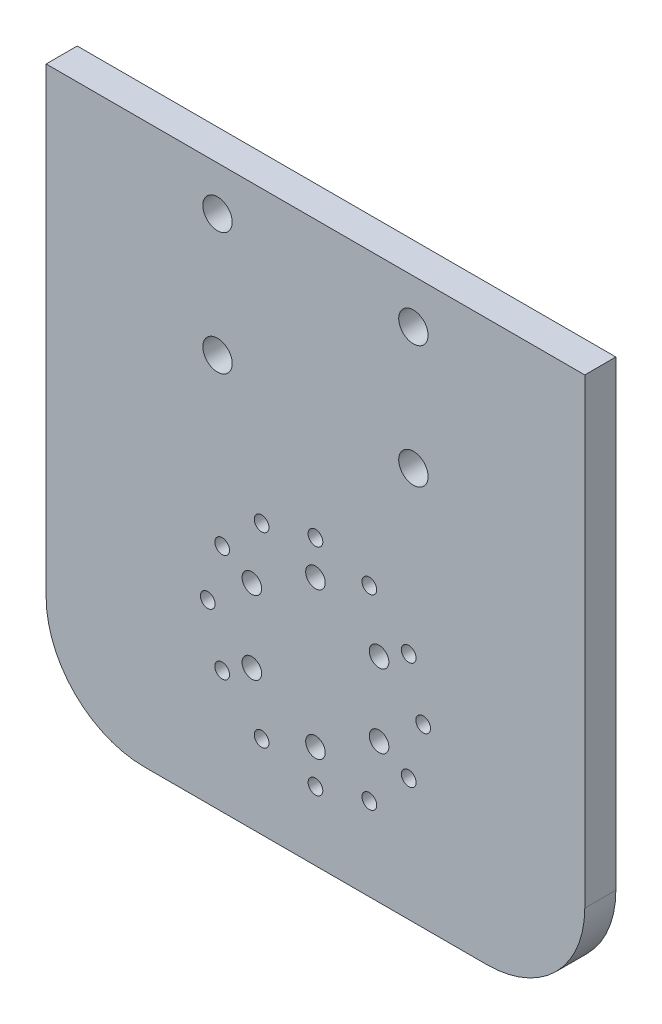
ISO-10303-21;
HEADER;
FILE_DESCRIPTION(('STEP AP214'),'2;1');
FILE_NAME('part.step','',(''),(''),'','','');
FILE_SCHEMA(('AUTOMOTIVE_DESIGN { 1 0 10303 214 1 1 1 1 }'));
ENDSEC;
DATA;
#1=APPLICATION_CONTEXT('core data for automotive mechanical design processes');
#2=APPLICATION_PROTOCOL_DEFINITION('international standard','automotive_design',2000,#1);
#3=PRODUCT_CONTEXT('',#1,'mechanical');
#4=PRODUCT('Part','Part','',(#3));
#5=PRODUCT_RELATED_PRODUCT_CATEGORY('part','',(#4));
#6=PRODUCT_DEFINITION_FORMATION('','',#4);
#7=PRODUCT_DEFINITION_CONTEXT('part definition',#1,'design');
#8=PRODUCT_DEFINITION('design','',#6,#7);
#9=PRODUCT_DEFINITION_SHAPE('','',#8);
#10=(LENGTH_UNIT() NAMED_UNIT(*) SI_UNIT(.MILLI.,.METRE.));
#11=(NAMED_UNIT(*) PLANE_ANGLE_UNIT() SI_UNIT($,.RADIAN.));
#12=(NAMED_UNIT(*) SI_UNIT($,.STERADIAN.) SOLID_ANGLE_UNIT());
#13=UNCERTAINTY_MEASURE_WITH_UNIT(LENGTH_MEASURE(1.E-05),#10,'distance_accuracy_value','');
#14=(GEOMETRIC_REPRESENTATION_CONTEXT(3) GLOBAL_UNCERTAINTY_ASSIGNED_CONTEXT((#13)) GLOBAL_UNIT_ASSIGNED_CONTEXT((#10,
#11,#12)) REPRESENTATION_CONTEXT('',''));
#15=CARTESIAN_POINT('',(0.,0.,0.));
#16=DIRECTION('',(0.,0.,1.));
#17=DIRECTION('',(1.,0.,0.));
#18=AXIS2_PLACEMENT_3D('',#15,#16,#17);
#19=CARTESIAN_POINT('',(0.,0.,6.35));
#20=DIRECTION('',(0.,0.,1.));
#21=DIRECTION('',(1.,0.,0.));
#22=AXIS2_PLACEMENT_3D('',#19,#20,#21);
#23=PLANE('',#22);
#24=CARTESIAN_POINT('',(20.,44.3,6.35));
#25=DIRECTION('',(0.,0.,1.));
#26=DIRECTION('',(1.,0.,0.));
#27=AXIS2_PLACEMENT_3D('',#24,#25,#26);
#28=CIRCLE('',#27,3.00000000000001);
#29=CARTESIAN_POINT('',(23.,44.3,6.35));
#30=VERTEX_POINT('',#29);
#31=EDGE_CURVE('E297',#30,#30,#28,.T.);
#32=ORIENTED_EDGE('',*,*,#31,.F.);
#33=EDGE_LOOP('',(#32));
#34=FACE_BOUND('',#33,.T.);
#35=CARTESIAN_POINT('',(-20.,69.3,6.35));
#36=DIRECTION('',(0.,0.,1.));
#37=DIRECTION('',(1.,0.,0.));
#38=AXIS2_PLACEMENT_3D('',#35,#36,#37);
#39=CIRCLE('',#38,3.00000000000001);
#40=CARTESIAN_POINT('',(-17.,69.3,6.35));
#41=VERTEX_POINT('',#40);
#42=EDGE_CURVE('E311',#41,#41,#39,.T.);
#43=ORIENTED_EDGE('',*,*,#42,.F.);
#44=EDGE_LOOP('',(#43));
#45=FACE_BOUND('',#44,.T.);
#46=CARTESIAN_POINT('',(-19.0525588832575,11.0000000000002,6.35));
#47=DIRECTION('',(0.,0.,1.));
#48=DIRECTION('',(1.,0.,0.));
#49=AXIS2_PLACEMENT_3D('',#46,#47,#48);
#50=CIRCLE('',#49,1.5);
#51=CARTESIAN_POINT('',(-17.5525588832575,11.0000000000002,6.35));
#52=VERTEX_POINT('',#51);
#53=EDGE_CURVE('E328',#52,#52,#50,.T.);
#54=ORIENTED_EDGE('',*,*,#53,.F.);
#55=EDGE_LOOP('',(#54));
#56=FACE_BOUND('',#55,.T.);
#57=CARTESIAN_POINT('',(-19.0525588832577,-10.9999999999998,6.35));
#58=DIRECTION('',(0.,0.,1.));
#59=DIRECTION('',(1.,0.,0.));
#60=AXIS2_PLACEMENT_3D('',#57,#58,#59);
#61=CIRCLE('',#60,1.5);
#62=CARTESIAN_POINT('',(-17.5525588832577,-10.9999999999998,6.35));
#63=VERTEX_POINT('',#62);
#64=EDGE_CURVE('E342',#63,#63,#61,.T.);
#65=ORIENTED_EDGE('',*,*,#64,.F.);
#66=EDGE_LOOP('',(#65));
#67=FACE_BOUND('',#66,.T.);
#68=CARTESIAN_POINT('',(-1.53625178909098E-13,-22.,6.35));
#69=DIRECTION('',(0.,0.,1.));
#70=DIRECTION('',(1.,0.,0.));
#71=AXIS2_PLACEMENT_3D('',#68,#69,#70);
#72=CIRCLE('',#71,1.5);
#73=CARTESIAN_POINT('',(1.49999999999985,-22.,6.35));
#74=VERTEX_POINT('',#73);
#75=EDGE_CURVE('E363',#74,#74,#72,.T.);
#76=ORIENTED_EDGE('',*,*,#75,.F.);
#77=EDGE_LOOP('',(#76));
#78=FACE_BOUND('',#77,.T.);
#79=CARTESIAN_POINT('',(19.0525588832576,-11.0000000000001,6.35));
#80=DIRECTION('',(0.,0.,1.));
#81=DIRECTION('',(1.,0.,0.));
#82=AXIS2_PLACEMENT_3D('',#79,#80,#81);
#83=CIRCLE('',#82,1.5);
#84=CARTESIAN_POINT('',(20.5525588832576,-11.0000000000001,6.35));
#85=VERTEX_POINT('',#84);
#86=EDGE_CURVE('E380',#85,#85,#83,.T.);
#87=ORIENTED_EDGE('',*,*,#86,.F.);
#88=EDGE_LOOP('',(#87));
#89=FACE_BOUND('',#88,.T.);
#90=CARTESIAN_POINT('',(19.0525588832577,11.,6.35));
#91=DIRECTION('',(0.,0.,1.));
#92=DIRECTION('',(1.,0.,0.));
#93=AXIS2_PLACEMENT_3D('',#90,#91,#92);
#94=CIRCLE('',#93,1.5);
#95=CARTESIAN_POINT('',(20.5525588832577,11.,6.35));
#96=VERTEX_POINT('',#95);
#97=EDGE_CURVE('E394',#96,#96,#94,.T.);
#98=ORIENTED_EDGE('',*,*,#97,.F.);
#99=EDGE_LOOP('',(#98));
#100=FACE_BOUND('',#99,.T.);
#101=CARTESIAN_POINT('',(-12.9903810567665,7.50000000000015,6.35));
#102=DIRECTION('',(0.,0.,1.));
#103=DIRECTION('',(1.,0.,0.));
#104=AXIS2_PLACEMENT_3D('',#101,#102,#103);
#105=CIRCLE('',#104,2.);
#106=CARTESIAN_POINT('',(-10.9903810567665,7.50000000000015,6.35));
#107=VERTEX_POINT('',#106);
#108=EDGE_CURVE('E408',#107,#107,#105,.T.);
#109=ORIENTED_EDGE('',*,*,#108,.F.);
#110=EDGE_LOOP('',(#109));
#111=FACE_BOUND('',#110,.T.);
#112=CARTESIAN_POINT('',(-1.04744440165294E-13,-15.,6.35));
#113=DIRECTION('',(0.,0.,1.));
#114=DIRECTION('',(1.,0.,0.));
#115=AXIS2_PLACEMENT_3D('',#112,#113,#114);
#116=CIRCLE('',#115,2.);
#117=CARTESIAN_POINT('',(1.9999999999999,-15.,6.35));
#118=VERTEX_POINT('',#117);
#119=EDGE_CURVE('E422',#118,#118,#116,.T.);
#120=ORIENTED_EDGE('',*,*,#119,.F.);
#121=EDGE_LOOP('',(#120));
#122=FACE_BOUND('',#121,.T.);
#123=CARTESIAN_POINT('',(12.9903810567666,7.49999999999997,6.35));
#124=DIRECTION('',(0.,0.,1.));
#125=DIRECTION('',(1.,0.,0.));
#126=AXIS2_PLACEMENT_3D('',#123,#124,#125);
#127=CIRCLE('',#126,2.);
#128=CARTESIAN_POINT('',(14.9903810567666,7.49999999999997,6.35));
#129=VERTEX_POINT('',#128);
#130=EDGE_CURVE('E442',#129,#129,#127,.T.);
#131=ORIENTED_EDGE('',*,*,#130,.F.);
#132=EDGE_LOOP('',(#131));
#133=FACE_BOUND('',#132,.T.);
#134=CARTESIAN_POINT('',(0.,15.,6.35));
#135=DIRECTION('',(0.,0.,1.));
#136=DIRECTION('',(1.,0.,0.));
#137=AXIS2_PLACEMENT_3D('',#134,#135,#136);
#138=CIRCLE('',#137,2.);
#139=CARTESIAN_POINT('',(2.,15.,6.35));
#140=VERTEX_POINT('',#139);
#141=EDGE_CURVE('E133',#140,#140,#138,.T.);
#142=ORIENTED_EDGE('',*,*,#141,.F.);
#143=EDGE_LOOP('',(#142));
#144=FACE_BOUND('',#143,.T.);
#145=DIRECTION('',(0.,-1.,0.));
#146=VECTOR('',#145,1.);
#147=CARTESIAN_POINT('',(-55.,-36.,6.35));
#148=LINE('',#147,#146);
#149=CARTESIAN_POINT('',(-55.,78.3,6.35));
#150=VERTEX_POINT('',#149);
#151=CARTESIAN_POINT('',(-55.,-15.9999999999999,6.35));
#152=VERTEX_POINT('',#151);
#153=EDGE_CURVE('E123',#150,#152,#148,.T.);
#154=ORIENTED_EDGE('',*,*,#153,.T.);
#155=CARTESIAN_POINT('',(-35.,-15.9999999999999,6.35));
#156=DIRECTION('',(0.,0.,1.));
#157=DIRECTION('',(1.,0.,0.));
#158=AXIS2_PLACEMENT_3D('',#155,#156,#157);
#159=CIRCLE('',#158,20.);
#160=CARTESIAN_POINT('',(-35.,-36.,6.35));
#161=VERTEX_POINT('',#160);
#162=EDGE_CURVE('E53',#152,#161,#159,.T.);
#163=ORIENTED_EDGE('',*,*,#162,.T.);
#164=DIRECTION('',(1.,0.,0.));
#165=VECTOR('',#164,1.);
#166=CARTESIAN_POINT('',(-55.,-36.,6.35));
#167=LINE('',#166,#165);
#168=CARTESIAN_POINT('',(35.,-36.,6.35));
#169=VERTEX_POINT('',#168);
#170=EDGE_CURVE('E107',#161,#169,#167,.T.);
#171=ORIENTED_EDGE('',*,*,#170,.T.);
#172=CARTESIAN_POINT('',(35.,-15.9999999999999,6.35));
#173=DIRECTION('',(0.,0.,1.));
#174=DIRECTION('',(1.,0.,0.));
#175=AXIS2_PLACEMENT_3D('',#172,#173,#174);
#176=CIRCLE('',#175,20.);
#177=CARTESIAN_POINT('',(55.,-15.9999999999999,6.35));
#178=VERTEX_POINT('',#177);
#179=EDGE_CURVE('E61',#169,#178,#176,.T.);
#180=ORIENTED_EDGE('',*,*,#179,.T.);
#181=DIRECTION('',(0.,1.,0.));
#182=VECTOR('',#181,1.);
#183=CARTESIAN_POINT('',(55.,-36.,6.35));
#184=LINE('',#183,#182);
#185=CARTESIAN_POINT('',(55.,78.3,6.35));
#186=VERTEX_POINT('',#185);
#187=EDGE_CURVE('E97',#178,#186,#184,.T.);
#188=ORIENTED_EDGE('',*,*,#187,.T.);
#189=DIRECTION('',(-1.,0.,0.));
#190=VECTOR('',#189,1.);
#191=CARTESIAN_POINT('',(-55.,78.3,6.35));
#192=LINE('',#191,#190);
#193=EDGE_CURVE('E103',#186,#150,#192,.T.);
#194=ORIENTED_EDGE('',*,*,#193,.T.);
#195=EDGE_LOOP('',(#154,#163,#171,#180,#188,#194));
#196=FACE_BOUND('',#195,.T.);
#197=CARTESIAN_POINT('',(0.,22.,6.35));
#198=DIRECTION('',(0.,0.,1.));
#199=DIRECTION('',(1.,0.,0.));
#200=AXIS2_PLACEMENT_3D('',#197,#198,#199);
#201=CIRCLE('',#200,1.5);
#202=CARTESIAN_POINT('',(1.5,22.,6.35));
#203=VERTEX_POINT('',#202);
#204=EDGE_CURVE('E448',#203,#203,#201,.T.);
#205=ORIENTED_EDGE('',*,*,#204,.F.);
#206=EDGE_LOOP('',(#205));
#207=FACE_BOUND('',#206,.T.);
#208=CARTESIAN_POINT('',(12.9903810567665,-7.50000000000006,6.35));
#209=DIRECTION('',(0.,0.,1.));
#210=DIRECTION('',(1.,0.,0.));
#211=AXIS2_PLACEMENT_3D('',#208,#209,#210);
#212=CIRCLE('',#211,2.);
#213=CARTESIAN_POINT('',(14.9903810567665,-7.50000000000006,6.35));
#214=VERTEX_POINT('',#213);
#215=EDGE_CURVE('E433',#214,#214,#212,.T.);
#216=ORIENTED_EDGE('',*,*,#215,.F.);
#217=EDGE_LOOP('',(#216));
#218=FACE_BOUND('',#217,.T.);
#219=CARTESIAN_POINT('',(-12.9903810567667,-7.49999999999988,6.35));
#220=DIRECTION('',(0.,0.,1.));
#221=DIRECTION('',(1.,0.,0.));
#222=AXIS2_PLACEMENT_3D('',#219,#220,#221);
#223=CIRCLE('',#222,2.);
#224=CARTESIAN_POINT('',(-10.9903810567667,-7.49999999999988,6.35));
#225=VERTEX_POINT('',#224);
#226=EDGE_CURVE('E417',#225,#225,#223,.T.);
#227=ORIENTED_EDGE('',*,*,#226,.F.);
#228=EDGE_LOOP('',(#227));
#229=FACE_BOUND('',#228,.T.);
#230=CARTESIAN_POINT('',(11.,19.0525588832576,6.35));
#231=DIRECTION('',(0.,0.,1.));
#232=DIRECTION('',(1.,0.,0.));
#233=AXIS2_PLACEMENT_3D('',#230,#231,#232);
#234=CIRCLE('',#233,1.5);
#235=CARTESIAN_POINT('',(12.5,19.0525588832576,6.35));
#236=VERTEX_POINT('',#235);
#237=EDGE_CURVE('E402',#236,#236,#234,.T.);
#238=ORIENTED_EDGE('',*,*,#237,.F.);
#239=EDGE_LOOP('',(#238));
#240=FACE_BOUND('',#239,.T.);
#241=CARTESIAN_POINT('',(22.,0.,6.35));
#242=DIRECTION('',(0.,0.,1.));
#243=DIRECTION('',(1.,0.,0.));
#244=AXIS2_PLACEMENT_3D('',#241,#242,#243);
#245=CIRCLE('',#244,1.5);
#246=CARTESIAN_POINT('',(23.5,0.,6.35));
#247=VERTEX_POINT('',#246);
#248=EDGE_CURVE('E384',#247,#247,#245,.T.);
#249=ORIENTED_EDGE('',*,*,#248,.F.);
#250=EDGE_LOOP('',(#249));
#251=FACE_BOUND('',#250,.T.);
#252=CARTESIAN_POINT('',(10.9999999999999,-19.0525588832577,6.35));
#253=DIRECTION('',(0.,0.,1.));
#254=DIRECTION('',(1.,0.,0.));
#255=AXIS2_PLACEMENT_3D('',#252,#253,#254);
#256=CIRCLE('',#255,1.5);
#257=CARTESIAN_POINT('',(12.4999999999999,-19.0525588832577,6.35));
#258=VERTEX_POINT('',#257);
#259=EDGE_CURVE('E369',#258,#258,#256,.T.);
#260=ORIENTED_EDGE('',*,*,#259,.F.);
#261=EDGE_LOOP('',(#260));
#262=FACE_BOUND('',#261,.T.);
#263=CARTESIAN_POINT('',(-11.0000000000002,-19.0525588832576,6.35));
#264=DIRECTION('',(0.,0.,1.));
#265=DIRECTION('',(1.,0.,0.));
#266=AXIS2_PLACEMENT_3D('',#263,#264,#265);
#267=CIRCLE('',#266,1.5);
#268=CARTESIAN_POINT('',(-9.50000000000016,-19.0525588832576,6.35));
#269=VERTEX_POINT('',#268);
#270=EDGE_CURVE('E354',#269,#269,#267,.T.);
#271=ORIENTED_EDGE('',*,*,#270,.F.);
#272=EDGE_LOOP('',(#271));
#273=FACE_BOUND('',#272,.T.);
#274=CARTESIAN_POINT('',(-22.,2.30437768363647E-13,6.35));
#275=DIRECTION('',(0.,0.,1.));
#276=DIRECTION('',(1.,0.,0.));
#277=AXIS2_PLACEMENT_3D('',#274,#275,#276);
#278=CIRCLE('',#277,1.5);
#279=CARTESIAN_POINT('',(-20.5,2.30437768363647E-13,6.35));
#280=VERTEX_POINT('',#279);
#281=EDGE_CURVE('E337',#280,#280,#278,.T.);
#282=ORIENTED_EDGE('',*,*,#281,.F.);
#283=EDGE_LOOP('',(#282));
#284=FACE_BOUND('',#283,.T.);
#285=CARTESIAN_POINT('',(-10.9999999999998,19.0525588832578,6.35));
#286=DIRECTION('',(0.,0.,1.));
#287=DIRECTION('',(1.,0.,0.));
#288=AXIS2_PLACEMENT_3D('',#285,#286,#287);
#289=CIRCLE('',#288,1.5);
#290=CARTESIAN_POINT('',(-9.49999999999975,19.0525588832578,6.35));
#291=VERTEX_POINT('',#290);
#292=EDGE_CURVE('E321',#291,#291,#289,.T.);
#293=ORIENTED_EDGE('',*,*,#292,.F.);
#294=EDGE_LOOP('',(#293));
#295=FACE_BOUND('',#294,.T.);
#296=CARTESIAN_POINT('',(-20.,44.3,6.35));
#297=DIRECTION('',(0.,0.,1.));
#298=DIRECTION('',(1.,0.,0.));
#299=AXIS2_PLACEMENT_3D('',#296,#297,#298);
#300=CIRCLE('',#299,3.00000000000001);
#301=CARTESIAN_POINT('',(-17.,44.3,6.35));
#302=VERTEX_POINT('',#301);
#303=EDGE_CURVE('E302',#302,#302,#300,.T.);
#304=ORIENTED_EDGE('',*,*,#303,.F.);
#305=EDGE_LOOP('',(#304));
#306=FACE_BOUND('',#305,.T.);
#307=CARTESIAN_POINT('',(20.,69.3,6.35));
#308=DIRECTION('',(0.,0.,1.));
#309=DIRECTION('',(1.,0.,0.));
#310=AXIS2_PLACEMENT_3D('',#307,#308,#309);
#311=CIRCLE('',#310,3.00000000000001);
#312=CARTESIAN_POINT('',(23.,69.3,6.35));
#313=VERTEX_POINT('',#312);
#314=EDGE_CURVE('E289',#313,#313,#311,.T.);
#315=ORIENTED_EDGE('',*,*,#314,.F.);
#316=EDGE_LOOP('',(#315));
#317=FACE_BOUND('',#316,.T.);
#318=ADVANCED_FACE('F44',(#34,#45,#56,#67,#78,#89,#100,#111,#122,#133,#144,#196,#207,#218,#229,
#240,#251,#262,#273,#284,#295,#306,#317),#23,.T.);
#319=CARTESIAN_POINT('',(0.,0.,0.));
#320=DIRECTION('',(0.,0.,1.));
#321=DIRECTION('',(1.,0.,0.));
#322=AXIS2_PLACEMENT_3D('',#319,#320,#321);
#323=PLANE('',#322);
#324=DIRECTION('',(1.,0.,0.));
#325=VECTOR('',#324,1.);
#326=CARTESIAN_POINT('',(-55.,-36.,0.));
#327=LINE('',#326,#325);
#328=CARTESIAN_POINT('',(-35.,-36.,0.));
#329=VERTEX_POINT('',#328);
#330=CARTESIAN_POINT('',(35.,-36.,0.));
#331=VERTEX_POINT('',#330);
#332=EDGE_CURVE('E128',#329,#331,#327,.T.);
#333=ORIENTED_EDGE('',*,*,#332,.F.);
#334=CARTESIAN_POINT('',(-35.,-15.9999999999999,0.));
#335=DIRECTION('',(0.,0.,1.));
#336=DIRECTION('',(1.,0.,0.));
#337=AXIS2_PLACEMENT_3D('',#334,#335,#336);
#338=CIRCLE('',#337,20.);
#339=CARTESIAN_POINT('',(-55.,-15.9999999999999,0.));
#340=VERTEX_POINT('',#339);
#341=EDGE_CURVE('E152',#329,#340,#338,.F.);
#342=ORIENTED_EDGE('',*,*,#341,.T.);
#343=DIRECTION('',(0.,-1.,0.));
#344=VECTOR('',#343,1.);
#345=CARTESIAN_POINT('',(-55.,-36.,0.));
#346=LINE('',#345,#344);
#347=CARTESIAN_POINT('',(-55.,78.3,0.));
#348=VERTEX_POINT('',#347);
#349=EDGE_CURVE('E137',#348,#340,#346,.T.);
#350=ORIENTED_EDGE('',*,*,#349,.F.);
#351=DIRECTION('',(-1.,0.,0.));
#352=VECTOR('',#351,1.);
#353=CARTESIAN_POINT('',(-55.,78.3,0.));
#354=LINE('',#353,#352);
#355=CARTESIAN_POINT('',(55.,78.3,0.));
#356=VERTEX_POINT('',#355);
#357=EDGE_CURVE('E136',#356,#348,#354,.T.);
#358=ORIENTED_EDGE('',*,*,#357,.F.);
#359=DIRECTION('',(0.,1.,0.));
#360=VECTOR('',#359,1.);
#361=CARTESIAN_POINT('',(55.,-36.,0.));
#362=LINE('',#361,#360);
#363=CARTESIAN_POINT('',(55.,-15.9999999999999,0.));
#364=VERTEX_POINT('',#363);
#365=EDGE_CURVE('E111',#364,#356,#362,.T.);
#366=ORIENTED_EDGE('',*,*,#365,.F.);
#367=CARTESIAN_POINT('',(35.,-15.9999999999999,0.));
#368=DIRECTION('',(0.,0.,1.));
#369=DIRECTION('',(1.,0.,0.));
#370=AXIS2_PLACEMENT_3D('',#367,#368,#369);
#371=CIRCLE('',#370,20.);
#372=EDGE_CURVE('E151',#364,#331,#371,.F.);
#373=ORIENTED_EDGE('',*,*,#372,.T.);
#374=EDGE_LOOP('',(#333,#342,#350,#358,#366,#373));
#375=FACE_BOUND('',#374,.T.);
#376=CARTESIAN_POINT('',(0.,15.,0.));
#377=DIRECTION('',(0.,0.,1.));
#378=DIRECTION('',(1.,0.,0.));
#379=AXIS2_PLACEMENT_3D('',#376,#377,#378);
#380=CIRCLE('',#379,2.);
#381=CARTESIAN_POINT('',(2.,15.,0.));
#382=VERTEX_POINT('',#381);
#383=EDGE_CURVE('E455',#382,#382,#380,.T.);
#384=ORIENTED_EDGE('',*,*,#383,.T.);
#385=EDGE_LOOP('',(#384));
#386=FACE_BOUND('',#385,.T.);
#387=CARTESIAN_POINT('',(0.,22.,0.));
#388=DIRECTION('',(0.,0.,1.));
#389=DIRECTION('',(1.,0.,0.));
#390=AXIS2_PLACEMENT_3D('',#387,#388,#389);
#391=CIRCLE('',#390,1.5);
#392=CARTESIAN_POINT('',(1.5,22.,0.));
#393=VERTEX_POINT('',#392);
#394=EDGE_CURVE('E443',#393,#393,#391,.T.);
#395=ORIENTED_EDGE('',*,*,#394,.T.);
#396=EDGE_LOOP('',(#395));
#397=FACE_BOUND('',#396,.T.);
#398=CARTESIAN_POINT('',(12.9903810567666,7.49999999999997,0.));
#399=DIRECTION('',(0.,0.,1.));
#400=DIRECTION('',(1.,0.,0.));
#401=AXIS2_PLACEMENT_3D('',#398,#399,#400);
#402=CIRCLE('',#401,2.);
#403=CARTESIAN_POINT('',(14.9903810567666,7.49999999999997,0.));
#404=VERTEX_POINT('',#403);
#405=EDGE_CURVE('E440',#404,#404,#402,.T.);
#406=ORIENTED_EDGE('',*,*,#405,.T.);
#407=EDGE_LOOP('',(#406));
#408=FACE_BOUND('',#407,.T.);
#409=CARTESIAN_POINT('',(12.9903810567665,-7.50000000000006,0.));
#410=DIRECTION('',(0.,0.,1.));
#411=DIRECTION('',(1.,0.,0.));
#412=AXIS2_PLACEMENT_3D('',#409,#410,#411);
#413=CIRCLE('',#412,2.);
#414=CARTESIAN_POINT('',(14.9903810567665,-7.50000000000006,0.));
#415=VERTEX_POINT('',#414);
#416=EDGE_CURVE('E427',#415,#415,#413,.T.);
#417=ORIENTED_EDGE('',*,*,#416,.T.);
#418=EDGE_LOOP('',(#417));
#419=FACE_BOUND('',#418,.T.);
#420=CARTESIAN_POINT('',(-1.04744440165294E-13,-15.,0.));
#421=DIRECTION('',(0.,0.,1.));
#422=DIRECTION('',(1.,0.,0.));
#423=AXIS2_PLACEMENT_3D('',#420,#421,#422);
#424=CIRCLE('',#423,2.);
#425=CARTESIAN_POINT('',(1.9999999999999,-15.,0.));
#426=VERTEX_POINT('',#425);
#427=EDGE_CURVE('E423',#426,#426,#424,.T.);
#428=ORIENTED_EDGE('',*,*,#427,.T.);
#429=EDGE_LOOP('',(#428));
#430=FACE_BOUND('',#429,.T.);
#431=CARTESIAN_POINT('',(-12.9903810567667,-7.49999999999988,0.));
#432=DIRECTION('',(0.,0.,1.));
#433=DIRECTION('',(1.,0.,0.));
#434=AXIS2_PLACEMENT_3D('',#431,#432,#433);
#435=CIRCLE('',#434,2.);
#436=CARTESIAN_POINT('',(-10.9903810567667,-7.49999999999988,0.));
#437=VERTEX_POINT('',#436);
#438=EDGE_CURVE('E415',#437,#437,#435,.T.);
#439=ORIENTED_EDGE('',*,*,#438,.T.);
#440=EDGE_LOOP('',(#439));
#441=FACE_BOUND('',#440,.T.);
#442=CARTESIAN_POINT('',(-12.9903810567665,7.50000000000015,0.));
#443=DIRECTION('',(0.,0.,1.));
#444=DIRECTION('',(1.,0.,0.));
#445=AXIS2_PLACEMENT_3D('',#442,#443,#444);
#446=CIRCLE('',#445,2.);
#447=CARTESIAN_POINT('',(-10.9903810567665,7.50000000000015,0.));
#448=VERTEX_POINT('',#447);
#449=EDGE_CURVE('E403',#448,#448,#446,.T.);
#450=ORIENTED_EDGE('',*,*,#449,.T.);
#451=EDGE_LOOP('',(#450));
#452=FACE_BOUND('',#451,.T.);
#453=CARTESIAN_POINT('',(11.,19.0525588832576,0.));
#454=DIRECTION('',(0.,0.,1.));
#455=DIRECTION('',(1.,0.,0.));
#456=AXIS2_PLACEMENT_3D('',#453,#454,#455);
#457=CIRCLE('',#456,1.5);
#458=CARTESIAN_POINT('',(12.5,19.0525588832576,0.));
#459=VERTEX_POINT('',#458);
#460=EDGE_CURVE('E396',#459,#459,#457,.T.);
#461=ORIENTED_EDGE('',*,*,#460,.T.);
#462=EDGE_LOOP('',(#461));
#463=FACE_BOUND('',#462,.T.);
#464=CARTESIAN_POINT('',(19.0525588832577,11.,0.));
#465=DIRECTION('',(0.,0.,1.));
#466=DIRECTION('',(1.,0.,0.));
#467=AXIS2_PLACEMENT_3D('',#464,#465,#466);
#468=CIRCLE('',#467,1.5);
#469=CARTESIAN_POINT('',(20.5525588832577,11.,0.));
#470=VERTEX_POINT('',#469);
#471=EDGE_CURVE('E386',#470,#470,#468,.T.);
#472=ORIENTED_EDGE('',*,*,#471,.T.);
#473=EDGE_LOOP('',(#472));
#474=FACE_BOUND('',#473,.T.);
#475=CARTESIAN_POINT('',(22.,0.,0.));
#476=DIRECTION('',(0.,0.,1.));
#477=DIRECTION('',(1.,0.,0.));
#478=AXIS2_PLACEMENT_3D('',#475,#476,#477);
#479=CIRCLE('',#478,1.5);
#480=CARTESIAN_POINT('',(23.5,0.,0.));
#481=VERTEX_POINT('',#480);
#482=EDGE_CURVE('E381',#481,#481,#479,.T.);
#483=ORIENTED_EDGE('',*,*,#482,.T.);
#484=EDGE_LOOP('',(#483));
#485=FACE_BOUND('',#484,.T.);
#486=CARTESIAN_POINT('',(19.0525588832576,-11.0000000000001,0.));
#487=DIRECTION('',(0.,0.,1.));
#488=DIRECTION('',(1.,0.,0.));
#489=AXIS2_PLACEMENT_3D('',#486,#487,#488);
#490=CIRCLE('',#489,1.5);
#491=CARTESIAN_POINT('',(20.5525588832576,-11.0000000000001,0.));
#492=VERTEX_POINT('',#491);
#493=EDGE_CURVE('E373',#492,#492,#490,.T.);
#494=ORIENTED_EDGE('',*,*,#493,.T.);
#495=EDGE_LOOP('',(#494));
#496=FACE_BOUND('',#495,.T.);
#497=CARTESIAN_POINT('',(10.9999999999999,-19.0525588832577,0.));
#498=DIRECTION('',(0.,0.,1.));
#499=DIRECTION('',(1.,0.,0.));
#500=AXIS2_PLACEMENT_3D('',#497,#498,#499);
#501=CIRCLE('',#500,1.5);
#502=CARTESIAN_POINT('',(12.4999999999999,-19.0525588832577,0.));
#503=VERTEX_POINT('',#502);
#504=EDGE_CURVE('E364',#503,#503,#501,.T.);
#505=ORIENTED_EDGE('',*,*,#504,.T.);
#506=EDGE_LOOP('',(#505));
#507=FACE_BOUND('',#506,.T.);
#508=CARTESIAN_POINT('',(-1.53625178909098E-13,-22.,0.));
#509=DIRECTION('',(0.,0.,1.));
#510=DIRECTION('',(1.,0.,0.));
#511=AXIS2_PLACEMENT_3D('',#508,#509,#510);
#512=CIRCLE('',#511,1.5);
#513=CARTESIAN_POINT('',(1.49999999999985,-22.,0.));
#514=VERTEX_POINT('',#513);
#515=EDGE_CURVE('E356',#514,#514,#512,.T.);
#516=ORIENTED_EDGE('',*,*,#515,.T.);
#517=EDGE_LOOP('',(#516));
#518=FACE_BOUND('',#517,.T.);
#519=CARTESIAN_POINT('',(-11.0000000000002,-19.0525588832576,0.));
#520=DIRECTION('',(0.,0.,1.));
#521=DIRECTION('',(1.,0.,0.));
#522=AXIS2_PLACEMENT_3D('',#519,#520,#521);
#523=CIRCLE('',#522,1.5);
#524=CARTESIAN_POINT('',(-9.50000000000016,-19.0525588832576,0.));
#525=VERTEX_POINT('',#524);
#526=EDGE_CURVE('E349',#525,#525,#523,.T.);
#527=ORIENTED_EDGE('',*,*,#526,.T.);
#528=EDGE_LOOP('',(#527));
#529=FACE_BOUND('',#528,.T.);
#530=CARTESIAN_POINT('',(-19.0525588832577,-10.9999999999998,0.));
#531=DIRECTION('',(0.,0.,1.));
#532=DIRECTION('',(1.,0.,0.));
#533=AXIS2_PLACEMENT_3D('',#530,#531,#532);
#534=CIRCLE('',#533,1.5);
#535=CARTESIAN_POINT('',(-17.5525588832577,-10.9999999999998,0.));
#536=VERTEX_POINT('',#535);
#537=EDGE_CURVE('E344',#536,#536,#534,.T.);
#538=ORIENTED_EDGE('',*,*,#537,.T.);
#539=EDGE_LOOP('',(#538));
#540=FACE_BOUND('',#539,.T.);
#541=CARTESIAN_POINT('',(-22.,2.30437768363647E-13,0.));
#542=DIRECTION('',(0.,0.,1.));
#543=DIRECTION('',(1.,0.,0.));
#544=AXIS2_PLACEMENT_3D('',#541,#542,#543);
#545=CIRCLE('',#544,1.5);
#546=CARTESIAN_POINT('',(-20.5,2.30437768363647E-13,0.));
#547=VERTEX_POINT('',#546);
#548=EDGE_CURVE('E334',#547,#547,#545,.T.);
#549=ORIENTED_EDGE('',*,*,#548,.T.);
#550=EDGE_LOOP('',(#549));
#551=FACE_BOUND('',#550,.T.);
#552=CARTESIAN_POINT('',(-19.0525588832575,11.0000000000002,0.));
#553=DIRECTION('',(0.,0.,1.));
#554=DIRECTION('',(1.,0.,0.));
#555=AXIS2_PLACEMENT_3D('',#552,#553,#554);
#556=CIRCLE('',#555,1.5);
#557=CARTESIAN_POINT('',(-17.5525588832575,11.0000000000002,0.));
#558=VERTEX_POINT('',#557);
#559=EDGE_CURVE('E324',#558,#558,#556,.T.);
#560=ORIENTED_EDGE('',*,*,#559,.T.);
#561=EDGE_LOOP('',(#560));
#562=FACE_BOUND('',#561,.T.);
#563=CARTESIAN_POINT('',(-10.9999999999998,19.0525588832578,0.));
#564=DIRECTION('',(0.,0.,1.));
#565=DIRECTION('',(1.,0.,0.));
#566=AXIS2_PLACEMENT_3D('',#563,#564,#565);
#567=CIRCLE('',#566,1.5);
#568=CARTESIAN_POINT('',(-9.49999999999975,19.0525588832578,0.));
#569=VERTEX_POINT('',#568);
#570=EDGE_CURVE('E320',#569,#569,#567,.T.);
#571=ORIENTED_EDGE('',*,*,#570,.T.);
#572=EDGE_LOOP('',(#571));
#573=FACE_BOUND('',#572,.T.);
#574=CARTESIAN_POINT('',(-20.,69.3,0.));
#575=DIRECTION('',(0.,0.,1.));
#576=DIRECTION('',(1.,0.,0.));
#577=AXIS2_PLACEMENT_3D('',#574,#575,#576);
#578=CIRCLE('',#577,3.00000000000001);
#579=CARTESIAN_POINT('',(-17.,69.3,0.));
#580=VERTEX_POINT('',#579);
#581=EDGE_CURVE('E310',#580,#580,#578,.T.);
#582=ORIENTED_EDGE('',*,*,#581,.T.);
#583=EDGE_LOOP('',(#582));
#584=FACE_BOUND('',#583,.T.);
#585=CARTESIAN_POINT('',(-20.,44.3,0.));
#586=DIRECTION('',(0.,0.,1.));
#587=DIRECTION('',(1.,0.,0.));
#588=AXIS2_PLACEMENT_3D('',#585,#586,#587);
#589=CIRCLE('',#588,3.00000000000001);
#590=CARTESIAN_POINT('',(-17.,44.3,0.));
#591=VERTEX_POINT('',#590);
#592=EDGE_CURVE('E304',#591,#591,#589,.T.);
#593=ORIENTED_EDGE('',*,*,#592,.T.);
#594=EDGE_LOOP('',(#593));
#595=FACE_BOUND('',#594,.T.);
#596=CARTESIAN_POINT('',(20.,44.3,0.));
#597=DIRECTION('',(0.,0.,1.));
#598=DIRECTION('',(1.,0.,0.));
#599=AXIS2_PLACEMENT_3D('',#596,#597,#598);
#600=CIRCLE('',#599,3.00000000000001);
#601=CARTESIAN_POINT('',(23.,44.3,0.));
#602=VERTEX_POINT('',#601);
#603=EDGE_CURVE('E294',#602,#602,#600,.T.);
#604=ORIENTED_EDGE('',*,*,#603,.T.);
#605=EDGE_LOOP('',(#604));
#606=FACE_BOUND('',#605,.T.);
#607=CARTESIAN_POINT('',(20.,69.3,0.));
#608=DIRECTION('',(0.,0.,1.));
#609=DIRECTION('',(1.,0.,0.));
#610=AXIS2_PLACEMENT_3D('',#607,#608,#609);
#611=CIRCLE('',#610,3.00000000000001);
#612=CARTESIAN_POINT('',(23.,69.3,0.));
#613=VERTEX_POINT('',#612);
#614=EDGE_CURVE('E288',#613,#613,#611,.T.);
#615=ORIENTED_EDGE('',*,*,#614,.T.);
#616=EDGE_LOOP('',(#615));
#617=FACE_BOUND('',#616,.T.);
#618=ADVANCED_FACE('F174',(#375,#386,#397,#408,#419,#430,#441,#452,#463,#474,#485,#496,#507,
#518,#529,#540,#551,#562,#573,#584,#595,#606,#617),#323,.F.);
#619=CARTESIAN_POINT('',(-55.,-36.,6.35));
#620=DIRECTION('',(0.,1.,0.));
#621=DIRECTION('',(0.,0.,1.));
#622=AXIS2_PLACEMENT_3D('',#619,#620,#621);
#623=PLANE('',#622);
#624=ORIENTED_EDGE('',*,*,#170,.F.);
#625=DIRECTION('',(0.,0.,-1.));
#626=VECTOR('',#625,1.);
#627=CARTESIAN_POINT('',(-35.,-36.,6.35));
#628=LINE('',#627,#626);
#629=EDGE_CURVE('E150',#161,#329,#628,.T.);
#630=ORIENTED_EDGE('',*,*,#629,.T.);
#631=ORIENTED_EDGE('',*,*,#332,.T.);
#632=DIRECTION('',(0.,0.,-1.));
#633=VECTOR('',#632,1.);
#634=CARTESIAN_POINT('',(35.,-36.,6.35));
#635=LINE('',#634,#633);
#636=EDGE_CURVE('E119',#331,#169,#635,.F.);
#637=ORIENTED_EDGE('',*,*,#636,.T.);
#638=EDGE_LOOP('',(#624,#630,#631,#637));
#639=FACE_BOUND('',#638,.T.);
#640=ADVANCED_FACE('F167',(#639),#623,.F.);
#641=CARTESIAN_POINT('',(55.,-36.,6.35));
#642=DIRECTION('',(-1.,0.,0.));
#643=DIRECTION('',(0.,0.,1.));
#644=AXIS2_PLACEMENT_3D('',#641,#642,#643);
#645=PLANE('',#644);
#646=ORIENTED_EDGE('',*,*,#187,.F.);
#647=DIRECTION('',(0.,0.,-1.));
#648=VECTOR('',#647,1.);
#649=CARTESIAN_POINT('',(55.,-15.9999999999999,6.35));
#650=LINE('',#649,#648);
#651=EDGE_CURVE('E11',#178,#364,#650,.T.);
#652=ORIENTED_EDGE('',*,*,#651,.T.);
#653=ORIENTED_EDGE('',*,*,#365,.T.);
#654=DIRECTION('',(0.,0.,-1.));
#655=VECTOR('',#654,1.);
#656=CARTESIAN_POINT('',(55.,78.3,6.35));
#657=LINE('',#656,#655);
#658=EDGE_CURVE('E112',#186,#356,#657,.T.);
#659=ORIENTED_EDGE('',*,*,#658,.F.);
#660=EDGE_LOOP('',(#646,#652,#653,#659));
#661=FACE_BOUND('',#660,.T.);
#662=ADVANCED_FACE('F115',(#661),#645,.F.);
#663=CARTESIAN_POINT('',(-55.,78.3,6.35));
#664=DIRECTION('',(0.,-1.,0.));
#665=DIRECTION('',(0.,0.,-1.));
#666=AXIS2_PLACEMENT_3D('',#663,#664,#665);
#667=PLANE('',#666);
#668=ORIENTED_EDGE('',*,*,#357,.T.);
#669=DIRECTION('',(0.,0.,-1.));
#670=VECTOR('',#669,1.);
#671=CARTESIAN_POINT('',(-55.,78.3,6.35));
#672=LINE('',#671,#670);
#673=EDGE_CURVE('E118',#150,#348,#672,.T.);
#674=ORIENTED_EDGE('',*,*,#673,.F.);
#675=ORIENTED_EDGE('',*,*,#193,.F.);
#676=ORIENTED_EDGE('',*,*,#658,.T.);
#677=EDGE_LOOP('',(#668,#674,#675,#676));
#678=FACE_BOUND('',#677,.T.);
#679=ADVANCED_FACE('F124',(#678),#667,.F.);
#680=CARTESIAN_POINT('',(-55.,-36.,6.35));
#681=DIRECTION('',(1.,0.,0.));
#682=DIRECTION('',(0.,0.,-1.));
#683=AXIS2_PLACEMENT_3D('',#680,#681,#682);
#684=PLANE('',#683);
#685=ORIENTED_EDGE('',*,*,#349,.T.);
#686=DIRECTION('',(0.,0.,-1.));
#687=VECTOR('',#686,1.);
#688=CARTESIAN_POINT('',(-55.,-15.9999999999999,6.35));
#689=LINE('',#688,#687);
#690=EDGE_CURVE('E68',#340,#152,#689,.F.);
#691=ORIENTED_EDGE('',*,*,#690,.T.);
#692=ORIENTED_EDGE('',*,*,#153,.F.);
#693=ORIENTED_EDGE('',*,*,#673,.T.);
#694=EDGE_LOOP('',(#685,#691,#692,#693));
#695=FACE_BOUND('',#694,.T.);
#696=ADVANCED_FACE('F175',(#695),#684,.F.);
#697=CARTESIAN_POINT('',(0.,15.,6.35));
#698=DIRECTION('',(0.,0.,-1.));
#699=DIRECTION('',(-1.,0.,0.));
#700=AXIS2_PLACEMENT_3D('',#697,#698,#699);
#701=CYLINDRICAL_SURFACE('',#700,2.);
#702=ORIENTED_EDGE('',*,*,#141,.T.);
#703=EDGE_LOOP('',(#702));
#704=FACE_BOUND('',#703,.T.);
#705=ORIENTED_EDGE('',*,*,#383,.F.);
#706=EDGE_LOOP('',(#705));
#707=FACE_BOUND('',#706,.T.);
#708=ADVANCED_FACE('F176',(#704,#707),#701,.F.);
#709=CARTESIAN_POINT('',(0.,22.,6.35));
#710=DIRECTION('',(0.,0.,-1.));
#711=DIRECTION('',(-1.,0.,0.));
#712=AXIS2_PLACEMENT_3D('',#709,#710,#711);
#713=CYLINDRICAL_SURFACE('',#712,1.5);
#714=ORIENTED_EDGE('',*,*,#204,.T.);
#715=EDGE_LOOP('',(#714));
#716=FACE_BOUND('',#715,.T.);
#717=ORIENTED_EDGE('',*,*,#394,.F.);
#718=EDGE_LOOP('',(#717));
#719=FACE_BOUND('',#718,.T.);
#720=ADVANCED_FACE('F184',(#716,#719),#713,.F.);
#721=CARTESIAN_POINT('',(12.9903810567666,7.49999999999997,6.35));
#722=DIRECTION('',(0.,0.,-1.));
#723=DIRECTION('',(-1.,0.,0.));
#724=AXIS2_PLACEMENT_3D('',#721,#722,#723);
#725=CYLINDRICAL_SURFACE('',#724,2.);
#726=ORIENTED_EDGE('',*,*,#130,.T.);
#727=EDGE_LOOP('',(#726));
#728=FACE_BOUND('',#727,.T.);
#729=ORIENTED_EDGE('',*,*,#405,.F.);
#730=EDGE_LOOP('',(#729));
#731=FACE_BOUND('',#730,.T.);
#732=ADVANCED_FACE('F205',(#728,#731),#725,.F.);
#733=CARTESIAN_POINT('',(12.9903810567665,-7.50000000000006,6.35));
#734=DIRECTION('',(0.,0.,-1.));
#735=DIRECTION('',(-1.,0.,0.));
#736=AXIS2_PLACEMENT_3D('',#733,#734,#735);
#737=CYLINDRICAL_SURFACE('',#736,2.);
#738=ORIENTED_EDGE('',*,*,#215,.T.);
#739=EDGE_LOOP('',(#738));
#740=FACE_BOUND('',#739,.T.);
#741=ORIENTED_EDGE('',*,*,#416,.F.);
#742=EDGE_LOOP('',(#741));
#743=FACE_BOUND('',#742,.T.);
#744=ADVANCED_FACE('F206',(#740,#743),#737,.F.);
#745=CARTESIAN_POINT('',(-1.04744440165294E-13,-15.,6.35));
#746=DIRECTION('',(0.,0.,-1.));
#747=DIRECTION('',(-1.,0.,0.));
#748=AXIS2_PLACEMENT_3D('',#745,#746,#747);
#749=CYLINDRICAL_SURFACE('',#748,2.);
#750=ORIENTED_EDGE('',*,*,#119,.T.);
#751=EDGE_LOOP('',(#750));
#752=FACE_BOUND('',#751,.T.);
#753=ORIENTED_EDGE('',*,*,#427,.F.);
#754=EDGE_LOOP('',(#753));
#755=FACE_BOUND('',#754,.T.);
#756=ADVANCED_FACE('F209',(#752,#755),#749,.F.);
#757=CARTESIAN_POINT('',(-12.9903810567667,-7.49999999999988,6.35));
#758=DIRECTION('',(0.,0.,-1.));
#759=DIRECTION('',(-1.,0.,0.));
#760=AXIS2_PLACEMENT_3D('',#757,#758,#759);
#761=CYLINDRICAL_SURFACE('',#760,2.);
#762=ORIENTED_EDGE('',*,*,#226,.T.);
#763=EDGE_LOOP('',(#762));
#764=FACE_BOUND('',#763,.T.);
#765=ORIENTED_EDGE('',*,*,#438,.F.);
#766=EDGE_LOOP('',(#765));
#767=FACE_BOUND('',#766,.T.);
#768=ADVANCED_FACE('F212',(#764,#767),#761,.F.);
#769=CARTESIAN_POINT('',(-12.9903810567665,7.50000000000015,6.35));
#770=DIRECTION('',(0.,0.,-1.));
#771=DIRECTION('',(-1.,0.,0.));
#772=AXIS2_PLACEMENT_3D('',#769,#770,#771);
#773=CYLINDRICAL_SURFACE('',#772,2.);
#774=ORIENTED_EDGE('',*,*,#108,.T.);
#775=EDGE_LOOP('',(#774));
#776=FACE_BOUND('',#775,.T.);
#777=ORIENTED_EDGE('',*,*,#449,.F.);
#778=EDGE_LOOP('',(#777));
#779=FACE_BOUND('',#778,.T.);
#780=ADVANCED_FACE('F217',(#776,#779),#773,.F.);
#781=CARTESIAN_POINT('',(11.,19.0525588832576,6.35));
#782=DIRECTION('',(0.,0.,-1.));
#783=DIRECTION('',(-1.,0.,0.));
#784=AXIS2_PLACEMENT_3D('',#781,#782,#783);
#785=CYLINDRICAL_SURFACE('',#784,1.5);
#786=ORIENTED_EDGE('',*,*,#237,.T.);
#787=EDGE_LOOP('',(#786));
#788=FACE_BOUND('',#787,.T.);
#789=ORIENTED_EDGE('',*,*,#460,.F.);
#790=EDGE_LOOP('',(#789));
#791=FACE_BOUND('',#790,.T.);
#792=ADVANCED_FACE('F225',(#788,#791),#785,.F.);
#793=CARTESIAN_POINT('',(19.0525588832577,11.,6.35));
#794=DIRECTION('',(0.,0.,-1.));
#795=DIRECTION('',(-1.,0.,0.));
#796=AXIS2_PLACEMENT_3D('',#793,#794,#795);
#797=CYLINDRICAL_SURFACE('',#796,1.5);
#798=ORIENTED_EDGE('',*,*,#97,.T.);
#799=EDGE_LOOP('',(#798));
#800=FACE_BOUND('',#799,.T.);
#801=ORIENTED_EDGE('',*,*,#471,.F.);
#802=EDGE_LOOP('',(#801));
#803=FACE_BOUND('',#802,.T.);
#804=ADVANCED_FACE('F226',(#800,#803),#797,.F.);
#805=CARTESIAN_POINT('',(22.,0.,6.35));
#806=DIRECTION('',(0.,0.,-1.));
#807=DIRECTION('',(-1.,0.,0.));
#808=AXIS2_PLACEMENT_3D('',#805,#806,#807);
#809=CYLINDRICAL_SURFACE('',#808,1.5);
#810=ORIENTED_EDGE('',*,*,#248,.T.);
#811=EDGE_LOOP('',(#810));
#812=FACE_BOUND('',#811,.T.);
#813=ORIENTED_EDGE('',*,*,#482,.F.);
#814=EDGE_LOOP('',(#813));
#815=FACE_BOUND('',#814,.T.);
#816=ADVANCED_FACE('F230',(#812,#815),#809,.F.);
#817=CARTESIAN_POINT('',(19.0525588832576,-11.0000000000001,6.35));
#818=DIRECTION('',(0.,0.,-1.));
#819=DIRECTION('',(-1.,0.,0.));
#820=AXIS2_PLACEMENT_3D('',#817,#818,#819);
#821=CYLINDRICAL_SURFACE('',#820,1.5);
#822=ORIENTED_EDGE('',*,*,#86,.T.);
#823=EDGE_LOOP('',(#822));
#824=FACE_BOUND('',#823,.T.);
#825=ORIENTED_EDGE('',*,*,#493,.F.);
#826=EDGE_LOOP('',(#825));
#827=FACE_BOUND('',#826,.T.);
#828=ADVANCED_FACE('F233',(#824,#827),#821,.F.);
#829=CARTESIAN_POINT('',(10.9999999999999,-19.0525588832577,6.35));
#830=DIRECTION('',(0.,0.,-1.));
#831=DIRECTION('',(-1.,0.,0.));
#832=AXIS2_PLACEMENT_3D('',#829,#830,#831);
#833=CYLINDRICAL_SURFACE('',#832,1.5);
#834=ORIENTED_EDGE('',*,*,#259,.T.);
#835=EDGE_LOOP('',(#834));
#836=FACE_BOUND('',#835,.T.);
#837=ORIENTED_EDGE('',*,*,#504,.F.);
#838=EDGE_LOOP('',(#837));
#839=FACE_BOUND('',#838,.T.);
#840=ADVANCED_FACE('F236',(#836,#839),#833,.F.);
#841=CARTESIAN_POINT('',(-1.53625178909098E-13,-22.,6.35));
#842=DIRECTION('',(0.,0.,-1.));
#843=DIRECTION('',(-1.,0.,0.));
#844=AXIS2_PLACEMENT_3D('',#841,#842,#843);
#845=CYLINDRICAL_SURFACE('',#844,1.5);
#846=ORIENTED_EDGE('',*,*,#75,.T.);
#847=EDGE_LOOP('',(#846));
#848=FACE_BOUND('',#847,.T.);
#849=ORIENTED_EDGE('',*,*,#515,.F.);
#850=EDGE_LOOP('',(#849));
#851=FACE_BOUND('',#850,.T.);
#852=ADVANCED_FACE('F242',(#848,#851),#845,.F.);
#853=CARTESIAN_POINT('',(-11.0000000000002,-19.0525588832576,6.35));
#854=DIRECTION('',(0.,0.,-1.));
#855=DIRECTION('',(-1.,0.,0.));
#856=AXIS2_PLACEMENT_3D('',#853,#854,#855);
#857=CYLINDRICAL_SURFACE('',#856,1.5);
#858=ORIENTED_EDGE('',*,*,#270,.T.);
#859=EDGE_LOOP('',(#858));
#860=FACE_BOUND('',#859,.T.);
#861=ORIENTED_EDGE('',*,*,#526,.F.);
#862=EDGE_LOOP('',(#861));
#863=FACE_BOUND('',#862,.T.);
#864=ADVANCED_FACE('F249',(#860,#863),#857,.F.);
#865=CARTESIAN_POINT('',(-19.0525588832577,-10.9999999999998,6.35));
#866=DIRECTION('',(0.,0.,-1.));
#867=DIRECTION('',(-1.,0.,0.));
#868=AXIS2_PLACEMENT_3D('',#865,#866,#867);
#869=CYLINDRICAL_SURFACE('',#868,1.5);
#870=ORIENTED_EDGE('',*,*,#64,.T.);
#871=EDGE_LOOP('',(#870));
#872=FACE_BOUND('',#871,.T.);
#873=ORIENTED_EDGE('',*,*,#537,.F.);
#874=EDGE_LOOP('',(#873));
#875=FACE_BOUND('',#874,.T.);
#876=ADVANCED_FACE('F247',(#872,#875),#869,.F.);
#877=CARTESIAN_POINT('',(-22.,2.30437768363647E-13,6.35));
#878=DIRECTION('',(0.,0.,-1.));
#879=DIRECTION('',(-1.,0.,0.));
#880=AXIS2_PLACEMENT_3D('',#877,#878,#879);
#881=CYLINDRICAL_SURFACE('',#880,1.5);
#882=ORIENTED_EDGE('',*,*,#281,.T.);
#883=EDGE_LOOP('',(#882));
#884=FACE_BOUND('',#883,.T.);
#885=ORIENTED_EDGE('',*,*,#548,.F.);
#886=EDGE_LOOP('',(#885));
#887=FACE_BOUND('',#886,.T.);
#888=ADVANCED_FACE('F255',(#884,#887),#881,.F.);
#889=CARTESIAN_POINT('',(-19.0525588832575,11.0000000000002,6.35));
#890=DIRECTION('',(0.,0.,-1.));
#891=DIRECTION('',(-1.,0.,0.));
#892=AXIS2_PLACEMENT_3D('',#889,#890,#891);
#893=CYLINDRICAL_SURFACE('',#892,1.5);
#894=ORIENTED_EDGE('',*,*,#53,.T.);
#895=EDGE_LOOP('',(#894));
#896=FACE_BOUND('',#895,.T.);
#897=ORIENTED_EDGE('',*,*,#559,.F.);
#898=EDGE_LOOP('',(#897));
#899=FACE_BOUND('',#898,.T.);
#900=ADVANCED_FACE('F256',(#896,#899),#893,.F.);
#901=CARTESIAN_POINT('',(-10.9999999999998,19.0525588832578,6.35));
#902=DIRECTION('',(0.,0.,-1.));
#903=DIRECTION('',(-1.,0.,0.));
#904=AXIS2_PLACEMENT_3D('',#901,#902,#903);
#905=CYLINDRICAL_SURFACE('',#904,1.5);
#906=ORIENTED_EDGE('',*,*,#292,.T.);
#907=EDGE_LOOP('',(#906));
#908=FACE_BOUND('',#907,.T.);
#909=ORIENTED_EDGE('',*,*,#570,.F.);
#910=EDGE_LOOP('',(#909));
#911=FACE_BOUND('',#910,.T.);
#912=ADVANCED_FACE('F265',(#908,#911),#905,.F.);
#913=CARTESIAN_POINT('',(-20.,69.3,6.35));
#914=DIRECTION('',(0.,0.,-1.));
#915=DIRECTION('',(-1.,0.,0.));
#916=AXIS2_PLACEMENT_3D('',#913,#914,#915);
#917=CYLINDRICAL_SURFACE('',#916,3.00000000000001);
#918=ORIENTED_EDGE('',*,*,#42,.T.);
#919=EDGE_LOOP('',(#918));
#920=FACE_BOUND('',#919,.T.);
#921=ORIENTED_EDGE('',*,*,#581,.F.);
#922=EDGE_LOOP('',(#921));
#923=FACE_BOUND('',#922,.T.);
#924=ADVANCED_FACE('F266',(#920,#923),#917,.F.);
#925=CARTESIAN_POINT('',(-20.,44.3,6.35));
#926=DIRECTION('',(0.,0.,-1.));
#927=DIRECTION('',(-1.,0.,0.));
#928=AXIS2_PLACEMENT_3D('',#925,#926,#927);
#929=CYLINDRICAL_SURFACE('',#928,3.00000000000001);
#930=ORIENTED_EDGE('',*,*,#303,.T.);
#931=EDGE_LOOP('',(#930));
#932=FACE_BOUND('',#931,.T.);
#933=ORIENTED_EDGE('',*,*,#592,.F.);
#934=EDGE_LOOP('',(#933));
#935=FACE_BOUND('',#934,.T.);
#936=ADVANCED_FACE('F269',(#932,#935),#929,.F.);
#937=CARTESIAN_POINT('',(20.,44.3,6.35));
#938=DIRECTION('',(0.,0.,-1.));
#939=DIRECTION('',(-1.,0.,0.));
#940=AXIS2_PLACEMENT_3D('',#937,#938,#939);
#941=CYLINDRICAL_SURFACE('',#940,3.00000000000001);
#942=ORIENTED_EDGE('',*,*,#31,.T.);
#943=EDGE_LOOP('',(#942));
#944=FACE_BOUND('',#943,.T.);
#945=ORIENTED_EDGE('',*,*,#603,.F.);
#946=EDGE_LOOP('',(#945));
#947=FACE_BOUND('',#946,.T.);
#948=ADVANCED_FACE('F273',(#944,#947),#941,.F.);
#949=CARTESIAN_POINT('',(20.,69.3,6.35));
#950=DIRECTION('',(0.,0.,-1.));
#951=DIRECTION('',(-1.,0.,0.));
#952=AXIS2_PLACEMENT_3D('',#949,#950,#951);
#953=CYLINDRICAL_SURFACE('',#952,3.00000000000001);
#954=ORIENTED_EDGE('',*,*,#314,.T.);
#955=EDGE_LOOP('',(#954));
#956=FACE_BOUND('',#955,.T.);
#957=ORIENTED_EDGE('',*,*,#614,.F.);
#958=EDGE_LOOP('',(#957));
#959=FACE_BOUND('',#958,.T.);
#960=ADVANCED_FACE('F279',(#956,#959),#953,.F.);
#961=CARTESIAN_POINT('',(-35.,-15.9999999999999,6.35));
#962=DIRECTION('',(0.,0.,-1.));
#963=DIRECTION('',(-1.,0.,0.));
#964=AXIS2_PLACEMENT_3D('',#961,#962,#963);
#965=CYLINDRICAL_SURFACE('',#964,20.);
#966=ORIENTED_EDGE('',*,*,#162,.F.);
#967=ORIENTED_EDGE('',*,*,#690,.F.);
#968=ORIENTED_EDGE('',*,*,#341,.F.);
#969=ORIENTED_EDGE('',*,*,#629,.F.);
#970=EDGE_LOOP('',(#966,#967,#968,#969));
#971=FACE_BOUND('',#970,.T.);
#972=ADVANCED_FACE('F168',(#971),#965,.T.);
#973=CARTESIAN_POINT('',(35.,-15.9999999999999,6.35));
#974=DIRECTION('',(0.,0.,-1.));
#975=DIRECTION('',(-1.,0.,0.));
#976=AXIS2_PLACEMENT_3D('',#973,#974,#975);
#977=CYLINDRICAL_SURFACE('',#976,20.);
#978=ORIENTED_EDGE('',*,*,#179,.F.);
#979=ORIENTED_EDGE('',*,*,#636,.F.);
#980=ORIENTED_EDGE('',*,*,#372,.F.);
#981=ORIENTED_EDGE('',*,*,#651,.F.);
#982=EDGE_LOOP('',(#978,#979,#980,#981));
#983=FACE_BOUND('',#982,.T.);
#984=ADVANCED_FACE('F50',(#983),#977,.T.);
#985=CLOSED_SHELL('',(#318,#618,#640,#662,#679,#696,#708,#720,#732,#744,#756,#768,#780,#792,
#804,#816,#828,#840,#852,#864,#876,#888,#900,#912,#924,#936,#948,#960,#972,#984));
#986=MANIFOLD_SOLID_BREP('B2',#985);
#987=ADVANCED_BREP_SHAPE_REPRESENTATION('',(#18,#986),#14);
#988=SHAPE_DEFINITION_REPRESENTATION(#9,#987);
ENDSEC;
END-ISO-10303-21;
